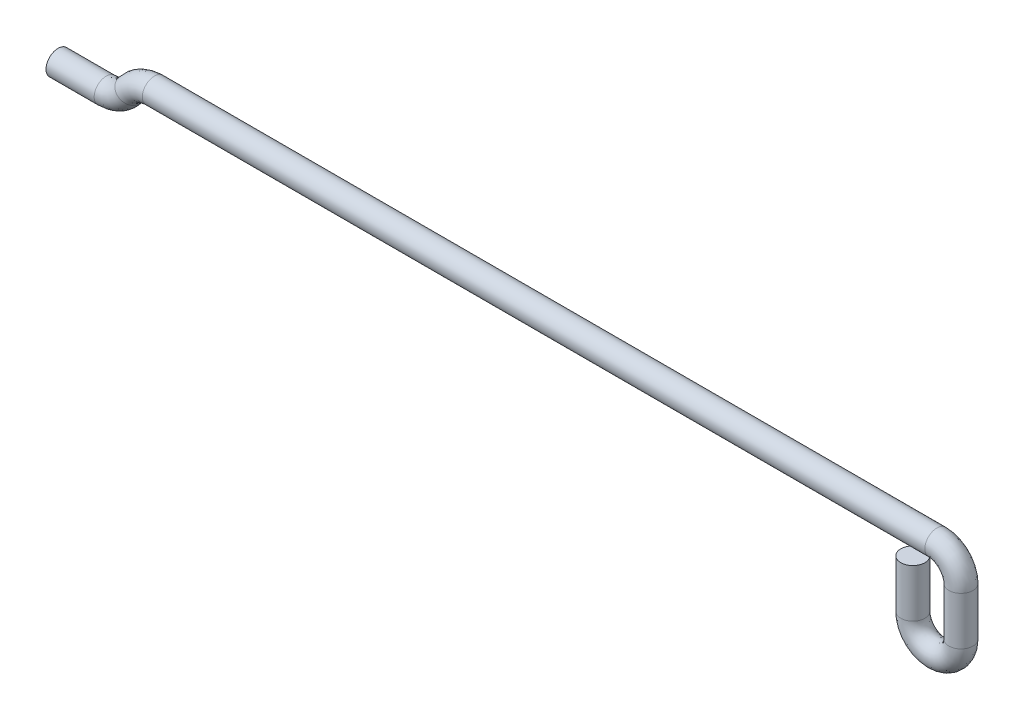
ISO-10303-21;
HEADER;
FILE_DESCRIPTION(('STEP AP214'),'2;1');
FILE_NAME('part.step','',(''),(''),'','','');
FILE_SCHEMA(('AUTOMOTIVE_DESIGN { 1 0 10303 214 1 1 1 1 }'));
ENDSEC;
DATA;
#1=APPLICATION_CONTEXT('core data for automotive mechanical design processes');
#2=APPLICATION_PROTOCOL_DEFINITION('international standard','automotive_design',2000,#1);
#3=PRODUCT_CONTEXT('',#1,'mechanical');
#4=PRODUCT('Part','Part','',(#3));
#5=PRODUCT_RELATED_PRODUCT_CATEGORY('part','',(#4));
#6=PRODUCT_DEFINITION_FORMATION('','',#4);
#7=PRODUCT_DEFINITION_CONTEXT('part definition',#1,'design');
#8=PRODUCT_DEFINITION('design','',#6,#7);
#9=PRODUCT_DEFINITION_SHAPE('','',#8);
#10=(LENGTH_UNIT() NAMED_UNIT(*) SI_UNIT(.MILLI.,.METRE.));
#11=(NAMED_UNIT(*) PLANE_ANGLE_UNIT() SI_UNIT($,.RADIAN.));
#12=(NAMED_UNIT(*) SI_UNIT($,.STERADIAN.) SOLID_ANGLE_UNIT());
#13=UNCERTAINTY_MEASURE_WITH_UNIT(LENGTH_MEASURE(1.E-05),#10,'distance_accuracy_value','');
#14=(GEOMETRIC_REPRESENTATION_CONTEXT(3) GLOBAL_UNCERTAINTY_ASSIGNED_CONTEXT((#13)) GLOBAL_UNIT_ASSIGNED_CONTEXT((#10,
#11,#12)) REPRESENTATION_CONTEXT('',''));
#15=CARTESIAN_POINT('',(0.,0.,0.));
#16=DIRECTION('',(0.,0.,1.));
#17=DIRECTION('',(1.,0.,0.));
#18=AXIS2_PLACEMENT_3D('',#15,#16,#17);
#19=CARTESIAN_POINT('',(-3.17469435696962,-5.82258863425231,0.));
#20=DIRECTION('',(-0.000593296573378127,-0.999999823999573,0.));
#21=DIRECTION('',(0.999999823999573,-0.000593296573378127,0.));
#22=AXIS2_PLACEMENT_3D('',#19,#20,#21);
#23=CIRCLE('',#22,0.79375);
#24=DIRECTION('',(0.,1.,0.));
#25=VECTOR('',#24,1.);
#26=SURFACE_OF_LINEAR_EXTRUSION('',#23,#25);
#27=CARTESIAN_POINT('',(-2.38094449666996,-5.82305956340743,0.));
#28=VERTEX_POINT('',#27);
#29=EDGE_CURVE('E35',#28,#28,#23,.T.);
#30=ORIENTED_EDGE('',*,*,#29,.F.);
#31=EDGE_LOOP('',(#30));
#32=FACE_BOUND('',#31,.T.);
#33=CARTESIAN_POINT('',(-3.17469435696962,-2.64758863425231,0.));
#34=DIRECTION('',(-0.000593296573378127,-0.999999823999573,0.));
#35=DIRECTION('',(0.999999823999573,-0.000593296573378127,0.));
#36=AXIS2_PLACEMENT_3D('',#33,#34,#35);
#37=CIRCLE('',#36,0.79375);
#38=CARTESIAN_POINT('',(-2.38094449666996,-2.64805956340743,0.));
#39=VERTEX_POINT('',#38);
#40=EDGE_CURVE('E10',#39,#39,#37,.T.);
#41=ORIENTED_EDGE('',*,*,#40,.T.);
#42=EDGE_LOOP('',(#41));
#43=FACE_BOUND('',#42,.T.);
#44=ADVANCED_FACE('F29',(#32,#43),#26,.F.);
#45=CARTESIAN_POINT('',(-0.000305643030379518,-5.82258827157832,0.));
#46=DIRECTION('',(0.000593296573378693,0.999999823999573,0.));
#47=DIRECTION('',(-0.999999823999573,0.000593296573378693,0.));
#48=AXIS2_PLACEMENT_3D('',#45,#46,#47);
#49=CIRCLE('',#48,0.79375);
#50=CARTESIAN_POINT('',(-1.5875,-5.82258845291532,0.));
#51=DIRECTION('',(0.,0.,-1.));
#52=AXIS1_PLACEMENT('',#50,#51);
#53=SURFACE_OF_REVOLUTION('',#49,#52);
#54=CARTESIAN_POINT('',(-0.79405550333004,-5.8221173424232,0.));
#55=VERTEX_POINT('',#54);
#56=EDGE_CURVE('E39',#55,#55,#49,.T.);
#57=ORIENTED_EDGE('',*,*,#56,.F.);
#58=EDGE_LOOP('',(#57));
#59=FACE_BOUND('',#58,.T.);
#60=ORIENTED_EDGE('',*,*,#29,.T.);
#61=EDGE_LOOP('',(#60));
#62=FACE_BOUND('',#61,.T.);
#63=ADVANCED_FACE('F50',(#59,#62),#53,.T.);
#64=CARTESIAN_POINT('',(-0.000305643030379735,-2.64758827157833,0.));
#65=DIRECTION('',(0.000593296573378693,0.999999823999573,0.));
#66=DIRECTION('',(-0.999999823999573,0.000593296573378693,0.));
#67=AXIS2_PLACEMENT_3D('',#64,#65,#66);
#68=CIRCLE('',#67,0.79375);
#69=DIRECTION('',(0.,-1.,0.));
#70=VECTOR('',#69,1.);
#71=SURFACE_OF_LINEAR_EXTRUSION('',#68,#70);
#72=CARTESIAN_POINT('',(-0.794055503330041,-2.64711734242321,0.));
#73=VERTEX_POINT('',#72);
#74=EDGE_CURVE('E43',#73,#73,#68,.T.);
#75=ORIENTED_EDGE('',*,*,#74,.F.);
#76=EDGE_LOOP('',(#75));
#77=FACE_BOUND('',#76,.T.);
#78=ORIENTED_EDGE('',*,*,#56,.T.);
#79=EDGE_LOOP('',(#78));
#80=FACE_BOUND('',#79,.T.);
#81=ADVANCED_FACE('F53',(#77,#80),#71,.F.);
#82=CARTESIAN_POINT('',(-1.58750018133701,-1.0603940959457,0.));
#83=DIRECTION('',(-0.999999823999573,0.000593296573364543,0.));
#84=DIRECTION('',(-0.000593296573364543,-0.999999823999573,0.));
#85=AXIS2_PLACEMENT_3D('',#82,#83,#84);
#86=CIRCLE('',#85,0.79375);
#87=CARTESIAN_POINT('',(-1.5875,-2.64758845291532,0.));
#88=DIRECTION('',(0.,0.,-1.));
#89=AXIS1_PLACEMENT('',#87,#88);
#90=SURFACE_OF_REVOLUTION('',#86,#89);
#91=CARTESIAN_POINT('',(-1.58797111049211,-1.85414395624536,0.));
#92=VERTEX_POINT('',#91);
#93=EDGE_CURVE('E65',#92,#92,#86,.T.);
#94=ORIENTED_EDGE('',*,*,#93,.F.);
#95=EDGE_LOOP('',(#94));
#96=FACE_BOUND('',#95,.T.);
#97=ORIENTED_EDGE('',*,*,#74,.T.);
#98=EDGE_LOOP('',(#97));
#99=FACE_BOUND('',#98,.T.);
#100=ADVANCED_FACE('F57',(#96,#99),#90,.T.);
#101=CARTESIAN_POINT('',(-53.181504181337,-1.0603940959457,0.));
#102=DIRECTION('',(-0.999999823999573,0.000593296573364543,0.));
#103=DIRECTION('',(-0.000593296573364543,-0.999999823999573,0.));
#104=AXIS2_PLACEMENT_3D('',#101,#102,#103);
#105=CIRCLE('',#104,0.79375);
#106=DIRECTION('',(1.,0.,0.));
#107=VECTOR('',#106,1.);
#108=SURFACE_OF_LINEAR_EXTRUSION('',#105,#107);
#109=CARTESIAN_POINT('',(-53.1819751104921,-1.85414395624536,0.));
#110=VERTEX_POINT('',#109);
#111=EDGE_CURVE('E68',#110,#110,#105,.T.);
#112=ORIENTED_EDGE('',*,*,#111,.F.);
#113=EDGE_LOOP('',(#112));
#114=FACE_BOUND('',#113,.T.);
#115=ORIENTED_EDGE('',*,*,#93,.T.);
#116=EDGE_LOOP('',(#115));
#117=FACE_BOUND('',#116,.T.);
#118=ADVANCED_FACE('F61',(#114,#117),#108,.F.);
#119=CARTESIAN_POINT('',(-54.7687595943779,-1.85402198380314,0.));
#120=DIRECTION('',(-0.600474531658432,-0.799643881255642,0.));
#121=DIRECTION('',(0.799643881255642,-0.600474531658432,0.));
#122=AXIS2_PLACEMENT_3D('',#119,#120,#121);
#123=CIRCLE('',#122,0.79375);
#124=CARTESIAN_POINT('',(-53.181504,-3.0444634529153,0.));
#125=DIRECTION('',(0.,0.,-1.));
#126=AXIS1_PLACEMENT('',#124,#125);
#127=SURFACE_OF_REVOLUTION('',#123,#126);
#128=CARTESIAN_POINT('',(-54.1340422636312,-2.33064864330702,0.));
#129=VERTEX_POINT('',#128);
#130=EDGE_CURVE('E72',#129,#129,#123,.T.);
#131=ORIENTED_EDGE('',*,*,#130,.F.);
#132=EDGE_LOOP('',(#131));
#133=FACE_BOUND('',#132,.T.);
#134=ORIENTED_EDGE('',*,*,#111,.T.);
#135=EDGE_LOOP('',(#134));
#136=FACE_BOUND('',#135,.T.);
#137=ADVANCED_FACE('F79',(#133,#136),#127,.T.);
#138=CARTESIAN_POINT('',(-56.356504,-2.64848284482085,0.));
#139=DIRECTION('',(-1.,0.,0.));
#140=DIRECTION('',(0.,-1.,0.));
#141=AXIS2_PLACEMENT_3D('',#138,#139,#140);
#142=CIRCLE('',#141,0.79375);
#143=CARTESIAN_POINT('',(-56.3576821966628,-0.662329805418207,0.));
#144=DIRECTION('',(0.,0.,1.));
#145=AXIS1_PLACEMENT('',#143,#144);
#146=SURFACE_OF_REVOLUTION('',#142,#145);
#147=CARTESIAN_POINT('',(-56.356504,-3.44223284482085,0.));
#148=VERTEX_POINT('',#147);
#149=EDGE_CURVE('E76',#148,#148,#142,.T.);
#150=ORIENTED_EDGE('',*,*,#149,.F.);
#151=EDGE_LOOP('',(#150));
#152=FACE_BOUND('',#151,.T.);
#153=ORIENTED_EDGE('',*,*,#130,.T.);
#154=EDGE_LOOP('',(#153));
#155=FACE_BOUND('',#154,.T.);
#156=ADVANCED_FACE('F82',(#152,#155),#146,.T.);
#157=CARTESIAN_POINT('',(-56.356504,-2.64848284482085,0.));
#158=DIRECTION('',(-1.,0.,0.));
#159=DIRECTION('',(0.,-1.,0.));
#160=AXIS2_PLACEMENT_3D('',#157,#158,#159);
#161=CYLINDRICAL_SURFACE('',#160,0.79375);
#162=ORIENTED_EDGE('',*,*,#149,.T.);
#163=EDGE_LOOP('',(#162));
#164=FACE_BOUND('',#163,.T.);
#165=CARTESIAN_POINT('',(-59.531504,-2.64848284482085,0.));
#166=DIRECTION('',(-1.,0.,0.));
#167=DIRECTION('',(0.,-1.,0.));
#168=AXIS2_PLACEMENT_3D('',#165,#166,#167);
#169=CIRCLE('',#168,0.79375);
#170=CARTESIAN_POINT('',(-59.531504,-3.44223284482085,0.));
#171=VERTEX_POINT('',#170);
#172=EDGE_CURVE('E77',#171,#171,#169,.T.);
#173=ORIENTED_EDGE('',*,*,#172,.F.);
#174=EDGE_LOOP('',(#173));
#175=FACE_BOUND('',#174,.T.);
#176=ADVANCED_FACE('F86',(#164,#175),#161,.T.);
#177=CARTESIAN_POINT('',(-3.17469435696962,-2.64758863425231,0.));
#178=DIRECTION('',(-0.000593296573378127,-0.999999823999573,0.));
#179=DIRECTION('',(0.999999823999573,-0.000593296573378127,0.));
#180=AXIS2_PLACEMENT_3D('',#177,#178,#179);
#181=PLANE('',#180);
#182=ORIENTED_EDGE('',*,*,#40,.F.);
#183=EDGE_LOOP('',(#182));
#184=FACE_BOUND('',#183,.T.);
#185=ADVANCED_FACE('F99',(#184),#181,.F.);
#186=CARTESIAN_POINT('',(-59.531504,-2.64848284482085,0.));
#187=DIRECTION('',(-1.,0.,0.));
#188=DIRECTION('',(0.,-1.,0.));
#189=AXIS2_PLACEMENT_3D('',#186,#187,#188);
#190=PLANE('',#189);
#191=ORIENTED_EDGE('',*,*,#172,.T.);
#192=EDGE_LOOP('',(#191));
#193=FACE_BOUND('',#192,.T.);
#194=ADVANCED_FACE('F96',(#193),#190,.T.);
#195=CLOSED_SHELL('',(#44,#63,#81,#100,#118,#137,#156,#176,#185,#194));
#196=MANIFOLD_SOLID_BREP('B2',#195);
#197=ADVANCED_BREP_SHAPE_REPRESENTATION('',(#18,#196),#14);
#198=SHAPE_DEFINITION_REPRESENTATION(#9,#197);
ENDSEC;
END-ISO-10303-21;
